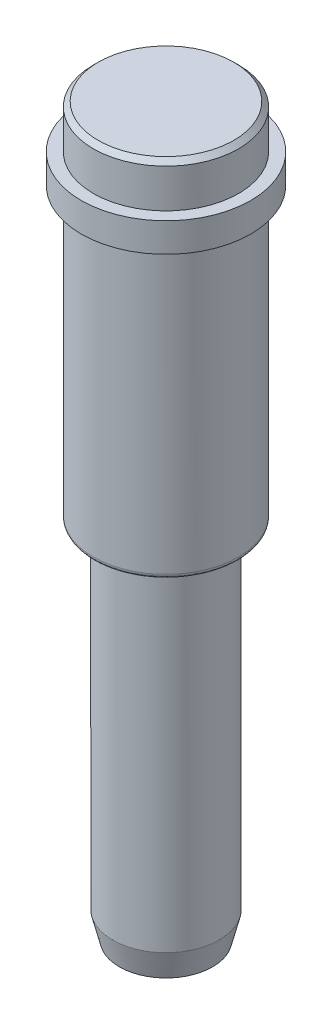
ISO-10303-21;
HEADER;
FILE_DESCRIPTION(('STEP AP214'),'2;1');
FILE_NAME('part.step','',(''),(''),'','','');
FILE_SCHEMA(('AUTOMOTIVE_DESIGN { 1 0 10303 214 1 1 1 1 }'));
ENDSEC;
DATA;
#1=APPLICATION_CONTEXT('core data for automotive mechanical design processes');
#2=APPLICATION_PROTOCOL_DEFINITION('international standard','automotive_design',2000,#1);
#3=PRODUCT_CONTEXT('',#1,'mechanical');
#4=PRODUCT('Part','Part','',(#3));
#5=PRODUCT_RELATED_PRODUCT_CATEGORY('part','',(#4));
#6=PRODUCT_DEFINITION_FORMATION('','',#4);
#7=PRODUCT_DEFINITION_CONTEXT('part definition',#1,'design');
#8=PRODUCT_DEFINITION('design','',#6,#7);
#9=PRODUCT_DEFINITION_SHAPE('','',#8);
#10=(LENGTH_UNIT() NAMED_UNIT(*) SI_UNIT(.MILLI.,.METRE.));
#11=(NAMED_UNIT(*) PLANE_ANGLE_UNIT() SI_UNIT($,.RADIAN.));
#12=(NAMED_UNIT(*) SI_UNIT($,.STERADIAN.) SOLID_ANGLE_UNIT());
#13=UNCERTAINTY_MEASURE_WITH_UNIT(LENGTH_MEASURE(1.E-05),#10,'distance_accuracy_value','');
#14=(GEOMETRIC_REPRESENTATION_CONTEXT(3) GLOBAL_UNCERTAINTY_ASSIGNED_CONTEXT((#13)) GLOBAL_UNIT_ASSIGNED_CONTEXT((#10,
#11,#12)) REPRESENTATION_CONTEXT('',''));
#15=CARTESIAN_POINT('',(0.,0.,0.));
#16=DIRECTION('',(0.,0.,1.));
#17=DIRECTION('',(1.,0.,0.));
#18=AXIS2_PLACEMENT_3D('',#15,#16,#17);
#19=CARTESIAN_POINT('',(-84.832,75.,199.832));
#20=DIRECTION('',(0.,1.,0.));
#21=DIRECTION('',(-1.,0.,0.));
#22=AXIS2_PLACEMENT_3D('',#19,#20,#21);
#23=PLANE('',#22);
#24=CARTESIAN_POINT('',(-99.,75.,214.));
#25=DIRECTION('',(0.,-1.,0.));
#26=DIRECTION('',(0.,0.,-1.));
#27=AXIS2_PLACEMENT_3D('',#24,#25,#26);
#28=CIRCLE('',#27,14.);
#29=CARTESIAN_POINT('',(-99.,75.,200.));
#30=VERTEX_POINT('',#29);
#31=EDGE_CURVE('E28',#30,#30,#28,.F.);
#32=ORIENTED_EDGE('',*,*,#31,.T.);
#33=EDGE_LOOP('',(#32));
#34=FACE_BOUND('',#33,.T.);
#35=ADVANCED_FACE('F24',(#34),#23,.T.);
#36=CARTESIAN_POINT('',(-108.7405,-75.,204.2595));
#37=DIRECTION('',(0.,-1.,0.));
#38=DIRECTION('',(1.,0.,0.));
#39=AXIS2_PLACEMENT_3D('',#36,#37,#38);
#40=PLANE('',#39);
#41=CARTESIAN_POINT('',(-99.,-75.,214.));
#42=DIRECTION('',(0.,1.,0.));
#43=DIRECTION('',(0.,0.,1.));
#44=AXIS2_PLACEMENT_3D('',#41,#42,#43);
#45=CIRCLE('',#44,9.62500000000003);
#46=CARTESIAN_POINT('',(-99.,-75.,223.625));
#47=VERTEX_POINT('',#46);
#48=EDGE_CURVE('E128',#47,#47,#45,.F.);
#49=ORIENTED_EDGE('',*,*,#48,.T.);
#50=EDGE_LOOP('',(#49));
#51=FACE_BOUND('',#50,.T.);
#52=ADVANCED_FACE('F169',(#51),#40,.T.);
#53=CARTESIAN_POINT('',(-99.,75.,214.));
#54=DIRECTION('',(0.,-1.,0.));
#55=DIRECTION('',(0.,0.,-1.));
#56=AXIS2_PLACEMENT_3D('',#53,#54,#55);
#57=CONICAL_SURFACE('',#56,14.,0.785398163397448);
#58=CARTESIAN_POINT('',(-99.,74.,214.));
#59=DIRECTION('',(0.,1.,0.));
#60=DIRECTION('',(1.,0.,0.));
#61=AXIS2_PLACEMENT_3D('',#58,#59,#60);
#62=CIRCLE('',#61,15.);
#63=CARTESIAN_POINT('',(-84.,74.,214.));
#64=VERTEX_POINT('',#63);
#65=EDGE_CURVE('E126',#64,#64,#62,.T.);
#66=ORIENTED_EDGE('',*,*,#65,.T.);
#67=EDGE_LOOP('',(#66));
#68=FACE_BOUND('',#67,.T.);
#69=ORIENTED_EDGE('',*,*,#31,.F.);
#70=EDGE_LOOP('',(#69));
#71=FACE_BOUND('',#70,.T.);
#72=ADVANCED_FACE('F166',(#68,#71),#57,.T.);
#73=CARTESIAN_POINT('',(-99.,-75.,214.));
#74=DIRECTION('',(0.,1.,0.));
#75=DIRECTION('',(0.,0.,1.));
#76=AXIS2_PLACEMENT_3D('',#73,#74,#75);
#77=CONICAL_SURFACE('',#76,9.62500000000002,0.244978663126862);
#78=ORIENTED_EDGE('',*,*,#48,.F.);
#79=EDGE_LOOP('',(#78));
#80=FACE_BOUND('',#79,.T.);
#81=CARTESIAN_POINT('',(-99.,-69.5,214.));
#82=DIRECTION('',(0.,-1.,0.));
#83=DIRECTION('',(-1.,0.,0.));
#84=AXIS2_PLACEMENT_3D('',#81,#82,#83);
#85=CIRCLE('',#84,11.);
#86=CARTESIAN_POINT('',(-110.,-69.5,214.));
#87=VERTEX_POINT('',#86);
#88=EDGE_CURVE('E117',#87,#87,#85,.T.);
#89=ORIENTED_EDGE('',*,*,#88,.T.);
#90=EDGE_LOOP('',(#89));
#91=FACE_BOUND('',#90,.T.);
#92=ADVANCED_FACE('F168',(#80,#91),#77,.T.);
#93=CARTESIAN_POINT('',(-99.,66.,214.));
#94=DIRECTION('',(0.,1.,0.));
#95=DIRECTION('',(0.,0.,1.));
#96=AXIS2_PLACEMENT_3D('',#93,#94,#95);
#97=CYLINDRICAL_SURFACE('',#96,15.);
#98=ORIENTED_EDGE('',*,*,#65,.F.);
#99=EDGE_LOOP('',(#98));
#100=FACE_BOUND('',#99,.T.);
#101=CARTESIAN_POINT('',(-99.,66.,214.));
#102=DIRECTION('',(0.,1.,0.));
#103=DIRECTION('',(0.,0.,1.));
#104=AXIS2_PLACEMENT_3D('',#101,#102,#103);
#105=CIRCLE('',#104,15.);
#106=CARTESIAN_POINT('',(-99.,66.,229.));
#107=VERTEX_POINT('',#106);
#108=EDGE_CURVE('E125',#107,#107,#105,.F.);
#109=ORIENTED_EDGE('',*,*,#108,.F.);
#110=EDGE_LOOP('',(#109));
#111=FACE_BOUND('',#110,.T.);
#112=ADVANCED_FACE('F177',(#100,#111),#97,.T.);
#113=CARTESIAN_POINT('',(-99.,0.,214.));
#114=DIRECTION('',(0.,-1.,0.));
#115=DIRECTION('',(0.,0.,-1.));
#116=AXIS2_PLACEMENT_3D('',#113,#114,#115);
#117=CYLINDRICAL_SURFACE('',#116,11.);
#118=CARTESIAN_POINT('',(-99.,0.,214.));
#119=DIRECTION('',(0.,-1.,0.));
#120=DIRECTION('',(0.,0.,-1.));
#121=AXIS2_PLACEMENT_3D('',#118,#119,#120);
#122=CIRCLE('',#121,11.);
#123=CARTESIAN_POINT('',(-99.,0.,203.));
#124=VERTEX_POINT('',#123);
#125=EDGE_CURVE('E59',#124,#124,#122,.F.);
#126=ORIENTED_EDGE('',*,*,#125,.F.);
#127=EDGE_LOOP('',(#126));
#128=FACE_BOUND('',#127,.T.);
#129=ORIENTED_EDGE('',*,*,#88,.F.);
#130=EDGE_LOOP('',(#129));
#131=FACE_BOUND('',#130,.T.);
#132=ADVANCED_FACE('F107',(#128,#131),#117,.T.);
#133=CARTESIAN_POINT('',(-81.29,66.,196.29));
#134=DIRECTION('',(0.,1.,0.));
#135=DIRECTION('',(-1.,0.,0.));
#136=AXIS2_PLACEMENT_3D('',#133,#134,#135);
#137=PLANE('',#136);
#138=ORIENTED_EDGE('',*,*,#108,.T.);
#139=EDGE_LOOP('',(#138));
#140=FACE_BOUND('',#139,.T.);
#141=CARTESIAN_POINT('',(-99.,66.,214.));
#142=DIRECTION('',(0.,-1.,0.));
#143=DIRECTION('',(0.,0.,-1.));
#144=AXIS2_PLACEMENT_3D('',#141,#142,#143);
#145=CIRCLE('',#144,17.5);
#146=CARTESIAN_POINT('',(-99.,66.,196.5));
#147=VERTEX_POINT('',#146);
#148=EDGE_CURVE('E58',#147,#147,#145,.F.);
#149=ORIENTED_EDGE('',*,*,#148,.T.);
#150=EDGE_LOOP('',(#149));
#151=FACE_BOUND('',#150,.T.);
#152=ADVANCED_FACE('F139',(#140,#151),#137,.T.);
#153=CARTESIAN_POINT('',(-84.832,0.,228.168));
#154=DIRECTION('',(0.,-1.,0.));
#155=DIRECTION('',(-1.,0.,0.));
#156=AXIS2_PLACEMENT_3D('',#153,#154,#155);
#157=PLANE('',#156);
#158=ORIENTED_EDGE('',*,*,#125,.T.);
#159=EDGE_LOOP('',(#158));
#160=FACE_BOUND('',#159,.T.);
#161=CARTESIAN_POINT('',(-85.0000000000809,2.05053042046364E-10,214.));
#162=CARTESIAN_POINT('',(-85.0000000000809,2.05053046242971E-10,185.999999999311));
#163=CARTESIAN_POINT('',(-112.999999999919,2.05053046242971E-10,185.999999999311));
#164=CARTESIAN_POINT('',(-112.999999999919,2.05053042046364E-10,214.));
#165=(BOUNDED_CURVE() B_SPLINE_CURVE(3,(#161,#162,#163,#164),.UNSPECIFIED.,.F.,
.F.) B_SPLINE_CURVE_WITH_KNOTS((4,4),(0.,1.),
.UNSPECIFIED.) CURVE() GEOMETRIC_REPRESENTATION_ITEM() RATIONAL_B_SPLINE_CURVE((0.956578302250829,
0.318859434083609,0.318859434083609,0.956578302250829)) REPRESENTATION_ITEM(''));
#166=CARTESIAN_POINT('',(-85.0000000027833,1.23031824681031E-10,214.));
#167=VERTEX_POINT('',#166);
#168=CARTESIAN_POINT('',(-112.999999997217,1.23031824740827E-10,214.));
#169=VERTEX_POINT('',#168);
#170=EDGE_CURVE('E56',#167,#169,#165,.T.);
#171=ORIENTED_EDGE('',*,*,#170,.F.);
#172=CARTESIAN_POINT('',(-112.999999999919,2.05053041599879E-10,214.));
#173=CARTESIAN_POINT('',(-112.999999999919,2.05053045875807E-10,242.000000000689));
#174=CARTESIAN_POINT('',(-85.0000000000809,2.05053045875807E-10,242.000000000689));
#175=CARTESIAN_POINT('',(-85.0000000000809,2.05053041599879E-10,214.));
#176=(BOUNDED_CURVE() B_SPLINE_CURVE(3,(#172,#173,#174,#175),.UNSPECIFIED.,.F.,
.F.) B_SPLINE_CURVE_WITH_KNOTS((4,4),(0.,1.),
.UNSPECIFIED.) CURVE() GEOMETRIC_REPRESENTATION_ITEM() RATIONAL_B_SPLINE_CURVE((0.956578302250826,
0.318859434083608,0.318859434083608,0.956578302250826)) REPRESENTATION_ITEM(''));
#177=EDGE_CURVE('E49',#169,#167,#176,.T.);
#178=ORIENTED_EDGE('',*,*,#177,.F.);
#179=EDGE_LOOP('',(#171,#178));
#180=FACE_BOUND('',#179,.T.);
#181=ADVANCED_FACE('F54',(#160,#180),#157,.T.);
#182=CARTESIAN_POINT('',(-85.099833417,0.004995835,214.));
#183=CARTESIAN_POINT('',(-85.099833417,0.004995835,241.800333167));
#184=CARTESIAN_POINT('',(-112.900166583,0.004995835,241.800333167));
#185=CARTESIAN_POINT('',(-112.900166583,0.004995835,214.));
#186=CARTESIAN_POINT('',(-84.419946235,-0.063220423,214.));
#187=CARTESIAN_POINT('',(-84.419946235,-0.063220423,243.16010753));
#188=CARTESIAN_POINT('',(-113.580053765,-0.063220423,243.16010753));
#189=CARTESIAN_POINT('',(-113.580053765,-0.063220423,214.));
#190=CARTESIAN_POINT('',(-83.936779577,0.419946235,214.));
#191=CARTESIAN_POINT('',(-83.936779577,0.419946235,244.126440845));
#192=CARTESIAN_POINT('',(-114.063220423,0.419946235,244.126440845));
#193=CARTESIAN_POINT('',(-114.063220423,0.419946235,214.));
#194=CARTESIAN_POINT('',(-84.004995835,1.099833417,214.));
#195=CARTESIAN_POINT('',(-84.004995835,1.099833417,243.990008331));
#196=CARTESIAN_POINT('',(-113.995004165,1.099833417,243.990008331));
#197=CARTESIAN_POINT('',(-113.995004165,1.099833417,214.));
#198=(BOUNDED_SURFACE() B_SPLINE_SURFACE(3,3,((#182,#183,#184,#185),(#186,#187,#188,#189),(#190,
#191,#192,#193),(#194,#195,#196,#197)),.UNSPECIFIED.,.F.,.F.,
.F.) B_SPLINE_SURFACE_WITH_KNOTS((4,4),(4,4),(0.,1.),(0.,1.),
.UNSPECIFIED.) GEOMETRIC_REPRESENTATION_ITEM() RATIONAL_B_SPLINE_SURFACE(((1.,0.333333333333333,
0.333333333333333,1.),(0.755320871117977,0.251773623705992,0.251773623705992,0.755320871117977),
(0.755320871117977,0.251773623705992,0.251773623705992,0.755320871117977),(1.,0.333333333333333,
0.333333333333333,1.))) REPRESENTATION_ITEM('') SURFACE());
#199=CARTESIAN_POINT('',(-112.900166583,0.004995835,214.));
#200=CARTESIAN_POINT('',(-113.580053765,-0.063220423,214.));
#201=CARTESIAN_POINT('',(-114.063220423,0.419946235,214.));
#202=CARTESIAN_POINT('',(-113.995004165,1.099833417,214.));
#203=(BOUNDED_CURVE() B_SPLINE_CURVE(3,(#199,#200,#201,#202),.UNSPECIFIED.,.F.,
.F.) B_SPLINE_CURVE_WITH_KNOTS((4,4),(0.,1.),
.UNSPECIFIED.) CURVE() GEOMETRIC_REPRESENTATION_ITEM() RATIONAL_B_SPLINE_CURVE((1.,
0.755320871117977,0.755320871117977,1.)) REPRESENTATION_ITEM(''));
#204=CARTESIAN_POINT('',(-113.999999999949,1.,214.000000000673));
#205=VERTEX_POINT('',#204);
#206=EDGE_CURVE('E63',#169,#205,#203,.T.);
#207=CARTESIAN_POINT('',(-85.099833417,0.004995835,214.));
#208=CARTESIAN_POINT('',(-84.419946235,-0.063220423,214.));
#209=CARTESIAN_POINT('',(-83.936779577,0.419946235,214.));
#210=CARTESIAN_POINT('',(-84.004995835,1.099833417,214.));
#211=(BOUNDED_CURVE() B_SPLINE_CURVE(3,(#207,#208,#209,#210),.UNSPECIFIED.,.F.,
.F.) B_SPLINE_CURVE_WITH_KNOTS((4,4),(0.,1.),
.UNSPECIFIED.) CURVE() GEOMETRIC_REPRESENTATION_ITEM() RATIONAL_B_SPLINE_CURVE((1.,
0.755320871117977,0.755320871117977,1.)) REPRESENTATION_ITEM(''));
#212=CARTESIAN_POINT('',(-84.0000000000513,0.999999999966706,214.000000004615));
#213=VERTEX_POINT('',#212);
#214=EDGE_CURVE('E43',#213,#167,#211,.F.);
#215=CARTESIAN_POINT('',(-99.,1.,214.));
#216=DIRECTION('',(0.,-1.,0.));
#217=DIRECTION('',(-1.,0.,0.));
#218=AXIS2_PLACEMENT_3D('',#215,#216,#217);
#219=CIRCLE('',#218,15.);
#220=EDGE_CURVE('E66',#213,#205,#219,.T.);
#221=ORIENTED_EDGE('',*,*,#206,.F.);
#222=ORIENTED_EDGE('',*,*,#177,.T.);
#223=ORIENTED_EDGE('',*,*,#214,.F.);
#224=ORIENTED_EDGE('',*,*,#220,.T.);
#225=EDGE_LOOP('',(#221,#222,#223,#224));
#226=FACE_BOUND('',#225,.T.);
#227=ADVANCED_FACE('F64',(#226),#198,.T.);
#228=CARTESIAN_POINT('',(-99.,66.,214.));
#229=DIRECTION('',(0.,-1.,0.));
#230=DIRECTION('',(0.,0.,-1.));
#231=AXIS2_PLACEMENT_3D('',#228,#229,#230);
#232=CYLINDRICAL_SURFACE('',#231,17.5);
#233=CARTESIAN_POINT('',(-99.,60.,214.));
#234=DIRECTION('',(0.,-1.,0.));
#235=DIRECTION('',(0.,0.,-1.));
#236=AXIS2_PLACEMENT_3D('',#233,#234,#235);
#237=CIRCLE('',#236,17.5);
#238=CARTESIAN_POINT('',(-99.,60.,196.5));
#239=VERTEX_POINT('',#238);
#240=EDGE_CURVE('E151',#239,#239,#237,.T.);
#241=ORIENTED_EDGE('',*,*,#240,.F.);
#242=EDGE_LOOP('',(#241));
#243=FACE_BOUND('',#242,.T.);
#244=ORIENTED_EDGE('',*,*,#148,.F.);
#245=EDGE_LOOP('',(#244));
#246=FACE_BOUND('',#245,.T.);
#247=ADVANCED_FACE('F92',(#243,#246),#232,.T.);
#248=CARTESIAN_POINT('',(-112.900166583,0.004995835,214.));
#249=CARTESIAN_POINT('',(-112.900166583,0.004995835,186.199666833));
#250=CARTESIAN_POINT('',(-85.099833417,0.004995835,186.199666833));
#251=CARTESIAN_POINT('',(-85.099833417,0.004995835,214.));
#252=CARTESIAN_POINT('',(-113.580053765,-0.063220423,214.));
#253=CARTESIAN_POINT('',(-113.580053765,-0.063220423,184.83989247));
#254=CARTESIAN_POINT('',(-84.419946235,-0.063220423,184.83989247));
#255=CARTESIAN_POINT('',(-84.419946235,-0.063220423,214.));
#256=CARTESIAN_POINT('',(-114.063220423,0.419946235,214.));
#257=CARTESIAN_POINT('',(-114.063220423,0.419946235,183.873559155));
#258=CARTESIAN_POINT('',(-83.936779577,0.419946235,183.873559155));
#259=CARTESIAN_POINT('',(-83.936779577,0.419946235,214.));
#260=CARTESIAN_POINT('',(-113.995004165,1.099833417,214.));
#261=CARTESIAN_POINT('',(-113.995004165,1.099833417,184.009991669));
#262=CARTESIAN_POINT('',(-84.004995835,1.099833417,184.009991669));
#263=CARTESIAN_POINT('',(-84.004995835,1.099833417,214.));
#264=(BOUNDED_SURFACE() B_SPLINE_SURFACE(3,3,((#248,#249,#250,#251),(#252,#253,#254,#255),(#256,
#257,#258,#259),(#260,#261,#262,#263)),.UNSPECIFIED.,.F.,.F.,
.F.) B_SPLINE_SURFACE_WITH_KNOTS((4,4),(4,4),(0.,1.),(0.,1.),
.UNSPECIFIED.) GEOMETRIC_REPRESENTATION_ITEM() RATIONAL_B_SPLINE_SURFACE(((1.,0.333333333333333,
0.333333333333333,1.),(0.755320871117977,0.251773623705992,0.251773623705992,0.755320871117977),
(0.755320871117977,0.251773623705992,0.251773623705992,0.755320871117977),(1.,0.333333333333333,
0.333333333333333,1.))) REPRESENTATION_ITEM('') SURFACE());
#265=CARTESIAN_POINT('',(-99.,1.,214.));
#266=DIRECTION('',(0.,-1.,0.));
#267=DIRECTION('',(-1.,0.,0.));
#268=AXIS2_PLACEMENT_3D('',#265,#266,#267);
#269=CIRCLE('',#268,15.);
#270=EDGE_CURVE('E34',#205,#213,#269,.T.);
#271=ORIENTED_EDGE('',*,*,#170,.T.);
#272=ORIENTED_EDGE('',*,*,#206,.T.);
#273=ORIENTED_EDGE('',*,*,#270,.T.);
#274=ORIENTED_EDGE('',*,*,#214,.T.);
#275=EDGE_LOOP('',(#271,#272,#273,#274));
#276=FACE_BOUND('',#275,.T.);
#277=ADVANCED_FACE('F71',(#276),#264,.T.);
#278=CARTESIAN_POINT('',(-116.71,60.,196.29));
#279=DIRECTION('',(0.,-1.,0.));
#280=DIRECTION('',(1.,0.,0.));
#281=AXIS2_PLACEMENT_3D('',#278,#279,#280);
#282=PLANE('',#281);
#283=CARTESIAN_POINT('',(-99.,60.,214.));
#284=DIRECTION('',(0.,-1.,0.));
#285=DIRECTION('',(0.,0.,-1.));
#286=AXIS2_PLACEMENT_3D('',#283,#284,#285);
#287=CIRCLE('',#286,15.);
#288=CARTESIAN_POINT('',(-99.,60.,199.));
#289=VERTEX_POINT('',#288);
#290=EDGE_CURVE('E13',#289,#289,#287,.F.);
#291=ORIENTED_EDGE('',*,*,#290,.T.);
#292=EDGE_LOOP('',(#291));
#293=FACE_BOUND('',#292,.T.);
#294=ORIENTED_EDGE('',*,*,#240,.T.);
#295=EDGE_LOOP('',(#294));
#296=FACE_BOUND('',#295,.T.);
#297=ADVANCED_FACE('F26',(#293,#296),#282,.T.);
#298=CARTESIAN_POINT('',(-99.,60.,214.));
#299=DIRECTION('',(0.,-1.,0.));
#300=DIRECTION('',(0.,0.,-1.));
#301=AXIS2_PLACEMENT_3D('',#298,#299,#300);
#302=CYLINDRICAL_SURFACE('',#301,15.);
#303=ORIENTED_EDGE('',*,*,#270,.F.);
#304=ORIENTED_EDGE('',*,*,#220,.F.);
#305=EDGE_LOOP('',(#303,#304));
#306=FACE_BOUND('',#305,.T.);
#307=ORIENTED_EDGE('',*,*,#290,.F.);
#308=EDGE_LOOP('',(#307));
#309=FACE_BOUND('',#308,.T.);
#310=ADVANCED_FACE('F93',(#306,#309),#302,.T.);
#311=CLOSED_SHELL('',(#35,#52,#72,#92,#112,#132,#152,#181,#227,#247,#277,#297,#310));
#312=MANIFOLD_SOLID_BREP('B1',#311);
#313=ADVANCED_BREP_SHAPE_REPRESENTATION('',(#18,#312),#14);
#314=SHAPE_DEFINITION_REPRESENTATION(#9,#313);
ENDSEC;
END-ISO-10303-21;
